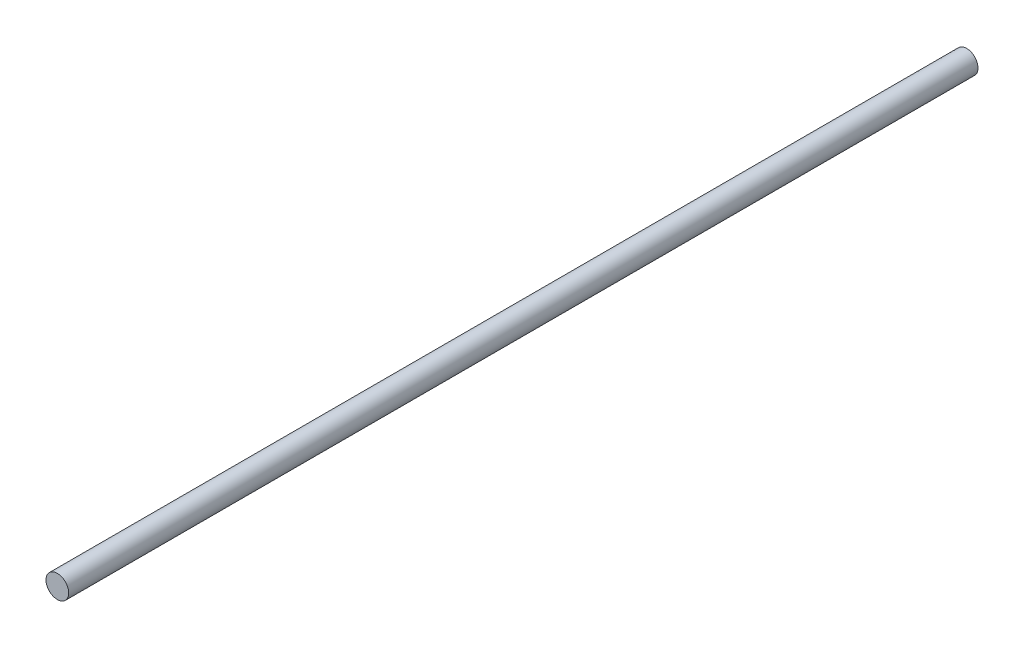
from build123d import *

# Parameters (mm, degrees)
SKETCH1_R           = 12.5
BOSS_EXTRUDE1_DEPTH = 1000


with BuildPart() as part:
    # Sketch1 → Boss-Extrude1 (new body)
    with BuildSketch(Plane.XY):
        Circle(SKETCH1_R)
    extrude(amount=BOSS_EXTRUDE1_DEPTH)


solid = part.part
